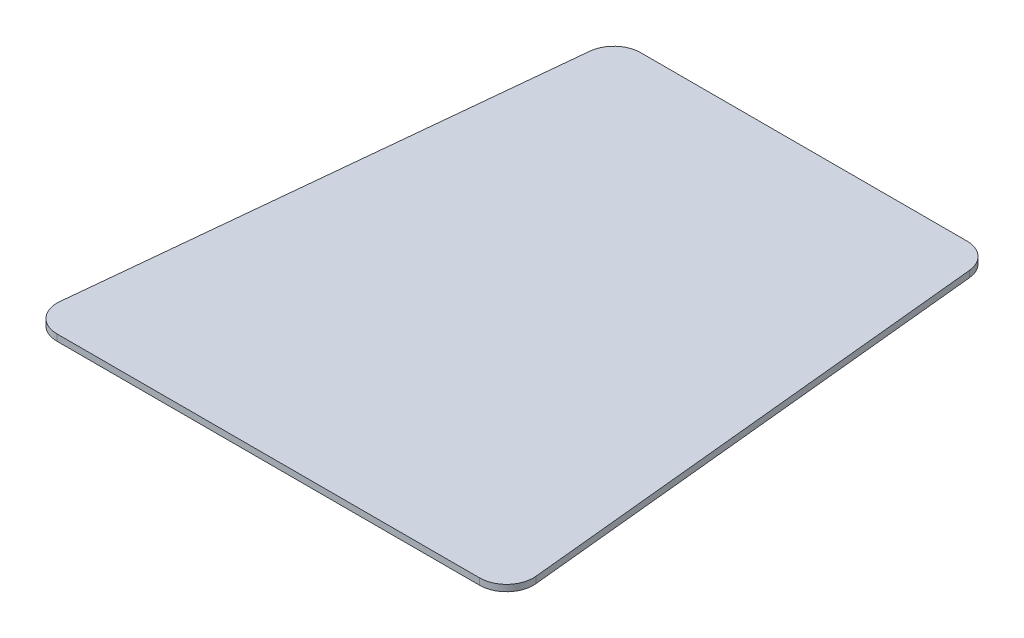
ISO-10303-21;
HEADER;
FILE_DESCRIPTION(('STEP AP214'),'2;1');
FILE_NAME('part.step','',(''),(''),'','','');
FILE_SCHEMA(('AUTOMOTIVE_DESIGN { 1 0 10303 214 1 1 1 1 }'));
ENDSEC;
DATA;
#1=APPLICATION_CONTEXT('core data for automotive mechanical design processes');
#2=APPLICATION_PROTOCOL_DEFINITION('international standard','automotive_design',2000,#1);
#3=PRODUCT_CONTEXT('',#1,'mechanical');
#4=PRODUCT('Part','Part','',(#3));
#5=PRODUCT_RELATED_PRODUCT_CATEGORY('part','',(#4));
#6=PRODUCT_DEFINITION_FORMATION('','',#4);
#7=PRODUCT_DEFINITION_CONTEXT('part definition',#1,'design');
#8=PRODUCT_DEFINITION('design','',#6,#7);
#9=PRODUCT_DEFINITION_SHAPE('','',#8);
#10=(LENGTH_UNIT() NAMED_UNIT(*) SI_UNIT(.MILLI.,.METRE.));
#11=(NAMED_UNIT(*) PLANE_ANGLE_UNIT() SI_UNIT($,.RADIAN.));
#12=(NAMED_UNIT(*) SI_UNIT($,.STERADIAN.) SOLID_ANGLE_UNIT());
#13=UNCERTAINTY_MEASURE_WITH_UNIT(LENGTH_MEASURE(1.E-05),#10,'distance_accuracy_value','');
#14=(GEOMETRIC_REPRESENTATION_CONTEXT(3) GLOBAL_UNCERTAINTY_ASSIGNED_CONTEXT((#13)) GLOBAL_UNIT_ASSIGNED_CONTEXT((#10,
#11,#12)) REPRESENTATION_CONTEXT('',''));
#15=CARTESIAN_POINT('',(0.,0.,0.));
#16=DIRECTION('',(0.,0.,1.));
#17=DIRECTION('',(1.,0.,0.));
#18=AXIS2_PLACEMENT_3D('',#15,#16,#17);
#19=CARTESIAN_POINT('',(-38.7033289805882,1.524,6.35000000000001));
#20=DIRECTION('',(0.,-1.,0.));
#21=DIRECTION('',(0.,0.,-1.));
#22=AXIS2_PLACEMENT_3D('',#19,#20,#21);
#23=CYLINDRICAL_SURFACE('',#22,6.35);
#24=CARTESIAN_POINT('',(-38.7033289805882,0.,6.35000000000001));
#25=DIRECTION('',(0.,1.,0.));
#26=DIRECTION('',(0.,0.,1.));
#27=AXIS2_PLACEMENT_3D('',#24,#25,#26);
#28=CIRCLE('',#27,6.35);
#29=CARTESIAN_POINT('',(-38.7033289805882,0.,0.));
#30=VERTEX_POINT('',#29);
#31=CARTESIAN_POINT('',(-45.0218151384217,0.,5.71815138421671));
#32=VERTEX_POINT('',#31);
#33=EDGE_CURVE('E127',#30,#32,#28,.T.);
#34=ORIENTED_EDGE('',*,*,#33,.T.);
#35=DIRECTION('',(0.,-1.,0.));
#36=VECTOR('',#35,1.);
#37=CARTESIAN_POINT('',(-45.0218151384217,1.524,5.71815138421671));
#38=LINE('',#37,#36);
#39=CARTESIAN_POINT('',(-45.0218151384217,1.524,5.71815138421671));
#40=VERTEX_POINT('',#39);
#41=EDGE_CURVE('E11',#40,#32,#38,.T.);
#42=ORIENTED_EDGE('',*,*,#41,.F.);
#43=CARTESIAN_POINT('',(-38.7033289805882,1.524,6.35000000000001));
#44=DIRECTION('',(0.,1.,0.));
#45=DIRECTION('',(0.,0.,1.));
#46=AXIS2_PLACEMENT_3D('',#43,#44,#45);
#47=CIRCLE('',#46,6.35);
#48=CARTESIAN_POINT('',(-38.7033289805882,1.524,0.));
#49=VERTEX_POINT('',#48);
#50=EDGE_CURVE('E141',#49,#40,#47,.T.);
#51=ORIENTED_EDGE('',*,*,#50,.F.);
#52=DIRECTION('',(0.,-1.,0.));
#53=VECTOR('',#52,1.);
#54=CARTESIAN_POINT('',(-38.7033289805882,1.524,0.));
#55=LINE('',#54,#53);
#56=EDGE_CURVE('E123',#49,#30,#55,.T.);
#57=ORIENTED_EDGE('',*,*,#56,.T.);
#58=EDGE_LOOP('',(#34,#42,#51,#57));
#59=FACE_BOUND('',#58,.T.);
#60=ADVANCED_FACE('F31',(#59),#23,.T.);
#61=CARTESIAN_POINT('',(-45.0218151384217,1.524,5.71815138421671));
#62=DIRECTION('',(0.995037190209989,0.,0.0995037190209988));
#63=DIRECTION('',(0.0995037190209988,0.,-0.995037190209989));
#64=AXIS2_PLACEMENT_3D('',#61,#62,#63);
#65=PLANE('',#64);
#66=DIRECTION('',(-0.0995037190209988,0.,0.995037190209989));
#67=VECTOR('',#66,1.);
#68=CARTESIAN_POINT('',(-45.0218151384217,0.,5.71815138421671));
#69=LINE('',#68,#67);
#70=CARTESIAN_POINT('',(-56.4518151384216,0.,120.018151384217));
#71=VERTEX_POINT('',#70);
#72=EDGE_CURVE('E130',#32,#71,#69,.T.);
#73=ORIENTED_EDGE('',*,*,#72,.T.);
#74=DIRECTION('',(0.,-1.,0.));
#75=VECTOR('',#74,1.);
#76=CARTESIAN_POINT('',(-56.4518151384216,1.524,120.018151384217));
#77=LINE('',#76,#75);
#78=CARTESIAN_POINT('',(-56.4518151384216,1.524,120.018151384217));
#79=VERTEX_POINT('',#78);
#80=EDGE_CURVE('E39',#79,#71,#77,.T.);
#81=ORIENTED_EDGE('',*,*,#80,.F.);
#82=DIRECTION('',(-0.0995037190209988,0.,0.995037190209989));
#83=VECTOR('',#82,1.);
#84=CARTESIAN_POINT('',(-45.0218151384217,1.524,5.71815138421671));
#85=LINE('',#84,#83);
#86=EDGE_CURVE('E90',#40,#79,#85,.T.);
#87=ORIENTED_EDGE('',*,*,#86,.F.);
#88=ORIENTED_EDGE('',*,*,#41,.T.);
#89=EDGE_LOOP('',(#73,#81,#87,#88));
#90=FACE_BOUND('',#89,.T.);
#91=ADVANCED_FACE('F176',(#90),#65,.F.);
#92=CARTESIAN_POINT('',(-50.1333289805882,1.524,120.65));
#93=DIRECTION('',(0.,-1.,0.));
#94=DIRECTION('',(0.,0.,-1.));
#95=AXIS2_PLACEMENT_3D('',#92,#93,#94);
#96=CYLINDRICAL_SURFACE('',#95,6.35);
#97=CARTESIAN_POINT('',(-50.1333289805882,0.,120.65));
#98=DIRECTION('',(0.,1.,0.));
#99=DIRECTION('',(0.,0.,1.));
#100=AXIS2_PLACEMENT_3D('',#97,#98,#99);
#101=CIRCLE('',#100,6.35);
#102=CARTESIAN_POINT('',(-50.1333289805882,0.,127.));
#103=VERTEX_POINT('',#102);
#104=EDGE_CURVE('E132',#71,#103,#101,.T.);
#105=ORIENTED_EDGE('',*,*,#104,.T.);
#106=DIRECTION('',(0.,-1.,0.));
#107=VECTOR('',#106,1.);
#108=CARTESIAN_POINT('',(-50.1333289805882,1.524,127.));
#109=LINE('',#108,#107);
#110=CARTESIAN_POINT('',(-50.1333289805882,1.524,127.));
#111=VERTEX_POINT('',#110);
#112=EDGE_CURVE('E148',#111,#103,#109,.T.);
#113=ORIENTED_EDGE('',*,*,#112,.F.);
#114=CARTESIAN_POINT('',(-50.1333289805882,1.524,120.65));
#115=DIRECTION('',(0.,1.,0.));
#116=DIRECTION('',(0.,0.,1.));
#117=AXIS2_PLACEMENT_3D('',#114,#115,#116);
#118=CIRCLE('',#117,6.35);
#119=EDGE_CURVE('E156',#79,#111,#118,.T.);
#120=ORIENTED_EDGE('',*,*,#119,.F.);
#121=ORIENTED_EDGE('',*,*,#80,.T.);
#122=EDGE_LOOP('',(#105,#113,#120,#121));
#123=FACE_BOUND('',#122,.T.);
#124=ADVANCED_FACE('F154',(#123),#96,.T.);
#125=CARTESIAN_POINT('',(-50.1333289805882,1.524,127.));
#126=DIRECTION('',(0.,0.,-1.));
#127=DIRECTION('',(-1.,0.,0.));
#128=AXIS2_PLACEMENT_3D('',#125,#126,#127);
#129=PLANE('',#128);
#130=DIRECTION('',(1.,0.,0.));
#131=VECTOR('',#130,1.);
#132=CARTESIAN_POINT('',(-50.1333289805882,0.,127.));
#133=LINE('',#132,#131);
#134=CARTESIAN_POINT('',(50.1333289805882,0.,127.));
#135=VERTEX_POINT('',#134);
#136=EDGE_CURVE('E134',#103,#135,#133,.T.);
#137=ORIENTED_EDGE('',*,*,#136,.T.);
#138=DIRECTION('',(0.,-1.,0.));
#139=VECTOR('',#138,1.);
#140=CARTESIAN_POINT('',(50.1333289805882,1.524,127.));
#141=LINE('',#140,#139);
#142=CARTESIAN_POINT('',(50.1333289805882,1.524,127.));
#143=VERTEX_POINT('',#142);
#144=EDGE_CURVE('E145',#143,#135,#141,.T.);
#145=ORIENTED_EDGE('',*,*,#144,.F.);
#146=DIRECTION('',(1.,0.,0.));
#147=VECTOR('',#146,1.);
#148=CARTESIAN_POINT('',(-50.1333289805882,1.524,127.));
#149=LINE('',#148,#147);
#150=EDGE_CURVE('E168',#111,#143,#149,.T.);
#151=ORIENTED_EDGE('',*,*,#150,.F.);
#152=ORIENTED_EDGE('',*,*,#112,.T.);
#153=EDGE_LOOP('',(#137,#145,#151,#152));
#154=FACE_BOUND('',#153,.T.);
#155=ADVANCED_FACE('F164',(#154),#129,.F.);
#156=CARTESIAN_POINT('',(50.1333289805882,1.524,120.65));
#157=DIRECTION('',(0.,-1.,0.));
#158=DIRECTION('',(0.,0.,-1.));
#159=AXIS2_PLACEMENT_3D('',#156,#157,#158);
#160=CYLINDRICAL_SURFACE('',#159,6.35);
#161=CARTESIAN_POINT('',(50.1333289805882,0.,120.65));
#162=DIRECTION('',(0.,1.,0.));
#163=DIRECTION('',(0.,0.,-1.));
#164=AXIS2_PLACEMENT_3D('',#161,#162,#163);
#165=CIRCLE('',#164,6.35);
#166=CARTESIAN_POINT('',(56.4518151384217,0.,120.018151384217));
#167=VERTEX_POINT('',#166);
#168=EDGE_CURVE('E136',#135,#167,#165,.T.);
#169=ORIENTED_EDGE('',*,*,#168,.T.);
#170=DIRECTION('',(0.,-1.,0.));
#171=VECTOR('',#170,1.);
#172=CARTESIAN_POINT('',(56.4518151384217,1.524,120.018151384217));
#173=LINE('',#172,#171);
#174=CARTESIAN_POINT('',(56.4518151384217,1.524,120.018151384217));
#175=VERTEX_POINT('',#174);
#176=EDGE_CURVE('E118',#175,#167,#173,.T.);
#177=ORIENTED_EDGE('',*,*,#176,.F.);
#178=CARTESIAN_POINT('',(50.1333289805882,1.524,120.65));
#179=DIRECTION('',(0.,1.,0.));
#180=DIRECTION('',(0.,0.,-1.));
#181=AXIS2_PLACEMENT_3D('',#178,#179,#180);
#182=CIRCLE('',#181,6.35);
#183=EDGE_CURVE('E109',#143,#175,#182,.T.);
#184=ORIENTED_EDGE('',*,*,#183,.F.);
#185=ORIENTED_EDGE('',*,*,#144,.T.);
#186=EDGE_LOOP('',(#169,#177,#184,#185));
#187=FACE_BOUND('',#186,.T.);
#188=ADVANCED_FACE('F167',(#187),#160,.T.);
#189=CARTESIAN_POINT('',(45.0218151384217,1.524,5.7181513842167));
#190=DIRECTION('',(-0.995037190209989,0.,0.099503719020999));
#191=DIRECTION('',(0.099503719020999,0.,0.995037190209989));
#192=AXIS2_PLACEMENT_3D('',#189,#190,#191);
#193=PLANE('',#192);
#194=DIRECTION('',(-0.099503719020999,0.,-0.995037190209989));
#195=VECTOR('',#194,1.);
#196=CARTESIAN_POINT('',(45.0218151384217,0.,5.7181513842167));
#197=LINE('',#196,#195);
#198=CARTESIAN_POINT('',(45.0218151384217,0.,5.7181513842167));
#199=VERTEX_POINT('',#198);
#200=EDGE_CURVE('E117',#167,#199,#197,.T.);
#201=ORIENTED_EDGE('',*,*,#200,.T.);
#202=DIRECTION('',(0.,-1.,0.));
#203=VECTOR('',#202,1.);
#204=CARTESIAN_POINT('',(45.0218151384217,1.524,5.7181513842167));
#205=LINE('',#204,#203);
#206=CARTESIAN_POINT('',(45.0218151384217,1.524,5.7181513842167));
#207=VERTEX_POINT('',#206);
#208=EDGE_CURVE('E114',#207,#199,#205,.T.);
#209=ORIENTED_EDGE('',*,*,#208,.F.);
#210=DIRECTION('',(-0.099503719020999,0.,-0.995037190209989));
#211=VECTOR('',#210,1.);
#212=CARTESIAN_POINT('',(45.0218151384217,1.524,5.7181513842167));
#213=LINE('',#212,#211);
#214=EDGE_CURVE('E103',#175,#207,#213,.T.);
#215=ORIENTED_EDGE('',*,*,#214,.F.);
#216=ORIENTED_EDGE('',*,*,#176,.T.);
#217=EDGE_LOOP('',(#201,#209,#215,#216));
#218=FACE_BOUND('',#217,.T.);
#219=ADVANCED_FACE('F115',(#218),#193,.F.);
#220=CARTESIAN_POINT('',(38.7033289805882,1.524,6.35));
#221=DIRECTION('',(0.,-1.,0.));
#222=DIRECTION('',(0.,0.,-1.));
#223=AXIS2_PLACEMENT_3D('',#220,#221,#222);
#224=CYLINDRICAL_SURFACE('',#223,6.35);
#225=CARTESIAN_POINT('',(38.7033289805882,0.,6.35));
#226=DIRECTION('',(0.,1.,0.));
#227=DIRECTION('',(0.,0.,1.));
#228=AXIS2_PLACEMENT_3D('',#225,#226,#227);
#229=CIRCLE('',#228,6.35);
#230=CARTESIAN_POINT('',(38.7033289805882,0.,0.));
#231=VERTEX_POINT('',#230);
#232=EDGE_CURVE('E76',#199,#231,#229,.T.);
#233=ORIENTED_EDGE('',*,*,#232,.T.);
#234=DIRECTION('',(0.,-1.,0.));
#235=VECTOR('',#234,1.);
#236=CARTESIAN_POINT('',(38.7033289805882,1.524,0.));
#237=LINE('',#236,#235);
#238=CARTESIAN_POINT('',(38.7033289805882,1.524,0.));
#239=VERTEX_POINT('',#238);
#240=EDGE_CURVE('E119',#239,#231,#237,.T.);
#241=ORIENTED_EDGE('',*,*,#240,.F.);
#242=CARTESIAN_POINT('',(38.7033289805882,1.524,6.35));
#243=DIRECTION('',(0.,1.,0.));
#244=DIRECTION('',(0.,0.,1.));
#245=AXIS2_PLACEMENT_3D('',#242,#243,#244);
#246=CIRCLE('',#245,6.35);
#247=EDGE_CURVE('E107',#207,#239,#246,.T.);
#248=ORIENTED_EDGE('',*,*,#247,.F.);
#249=ORIENTED_EDGE('',*,*,#208,.T.);
#250=EDGE_LOOP('',(#233,#241,#248,#249));
#251=FACE_BOUND('',#250,.T.);
#252=ADVANCED_FACE('F121',(#251),#224,.T.);
#253=CARTESIAN_POINT('',(38.7033289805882,1.524,0.));
#254=DIRECTION('',(0.,0.,1.));
#255=DIRECTION('',(1.,0.,0.));
#256=AXIS2_PLACEMENT_3D('',#253,#254,#255);
#257=PLANE('',#256);
#258=DIRECTION('',(-1.,0.,0.));
#259=VECTOR('',#258,1.);
#260=CARTESIAN_POINT('',(38.7033289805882,0.,0.));
#261=LINE('',#260,#259);
#262=EDGE_CURVE('E82',#231,#30,#261,.T.);
#263=ORIENTED_EDGE('',*,*,#262,.T.);
#264=ORIENTED_EDGE('',*,*,#56,.F.);
#265=DIRECTION('',(-1.,0.,0.));
#266=VECTOR('',#265,1.);
#267=CARTESIAN_POINT('',(38.7033289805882,1.524,0.));
#268=LINE('',#267,#266);
#269=EDGE_CURVE('E47',#239,#49,#268,.T.);
#270=ORIENTED_EDGE('',*,*,#269,.F.);
#271=ORIENTED_EDGE('',*,*,#240,.T.);
#272=EDGE_LOOP('',(#263,#264,#270,#271));
#273=FACE_BOUND('',#272,.T.);
#274=ADVANCED_FACE('F192',(#273),#257,.F.);
#275=CARTESIAN_POINT('',(-38.7033289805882,1.524,6.35000000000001));
#276=DIRECTION('',(0.,1.,0.));
#277=DIRECTION('',(0.,0.,1.));
#278=AXIS2_PLACEMENT_3D('',#275,#276,#277);
#279=PLANE('',#278);
#280=ORIENTED_EDGE('',*,*,#50,.T.);
#281=ORIENTED_EDGE('',*,*,#86,.T.);
#282=ORIENTED_EDGE('',*,*,#119,.T.);
#283=ORIENTED_EDGE('',*,*,#150,.T.);
#284=ORIENTED_EDGE('',*,*,#183,.T.);
#285=ORIENTED_EDGE('',*,*,#214,.T.);
#286=ORIENTED_EDGE('',*,*,#247,.T.);
#287=ORIENTED_EDGE('',*,*,#269,.T.);
#288=EDGE_LOOP('',(#280,#281,#282,#283,#284,#285,#286,#287));
#289=FACE_BOUND('',#288,.T.);
#290=ADVANCED_FACE('F105',(#289),#279,.T.);
#291=CARTESIAN_POINT('',(-38.7033289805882,0.,6.35000000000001));
#292=DIRECTION('',(0.,1.,0.));
#293=DIRECTION('',(0.,0.,1.));
#294=AXIS2_PLACEMENT_3D('',#291,#292,#293);
#295=PLANE('',#294);
#296=ORIENTED_EDGE('',*,*,#33,.F.);
#297=ORIENTED_EDGE('',*,*,#262,.F.);
#298=ORIENTED_EDGE('',*,*,#232,.F.);
#299=ORIENTED_EDGE('',*,*,#200,.F.);
#300=ORIENTED_EDGE('',*,*,#168,.F.);
#301=ORIENTED_EDGE('',*,*,#136,.F.);
#302=ORIENTED_EDGE('',*,*,#104,.F.);
#303=ORIENTED_EDGE('',*,*,#72,.F.);
#304=EDGE_LOOP('',(#296,#297,#298,#299,#300,#301,#302,#303));
#305=FACE_BOUND('',#304,.T.);
#306=ADVANCED_FACE('F160',(#305),#295,.F.);
#307=CLOSED_SHELL('',(#60,#91,#124,#155,#188,#219,#252,#274,#290,#306));
#308=MANIFOLD_SOLID_BREP('B2',#307);
#309=ADVANCED_BREP_SHAPE_REPRESENTATION('',(#18,#308),#14);
#310=SHAPE_DEFINITION_REPRESENTATION(#9,#309);
ENDSEC;
END-ISO-10303-21;
